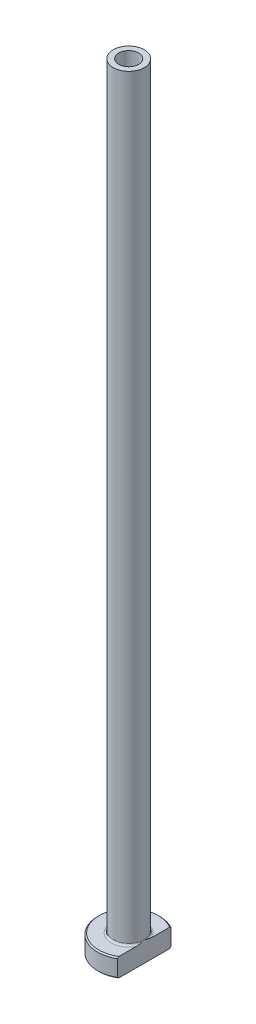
ISO-10303-21;
HEADER;
FILE_DESCRIPTION(('STEP AP214'),'2;1');
FILE_NAME('part.step','',(''),(''),'','','');
FILE_SCHEMA(('AUTOMOTIVE_DESIGN { 1 0 10303 214 1 1 1 1 }'));
ENDSEC;
DATA;
#1=APPLICATION_CONTEXT('core data for automotive mechanical design processes');
#2=APPLICATION_PROTOCOL_DEFINITION('international standard','automotive_design',2000,#1);
#3=PRODUCT_CONTEXT('',#1,'mechanical');
#4=PRODUCT('Part','Part','',(#3));
#5=PRODUCT_RELATED_PRODUCT_CATEGORY('part','',(#4));
#6=PRODUCT_DEFINITION_FORMATION('','',#4);
#7=PRODUCT_DEFINITION_CONTEXT('part definition',#1,'design');
#8=PRODUCT_DEFINITION('design','',#6,#7);
#9=PRODUCT_DEFINITION_SHAPE('','',#8);
#10=(LENGTH_UNIT() NAMED_UNIT(*) SI_UNIT(.MILLI.,.METRE.));
#11=(NAMED_UNIT(*) PLANE_ANGLE_UNIT() SI_UNIT($,.RADIAN.));
#12=(NAMED_UNIT(*) SI_UNIT($,.STERADIAN.) SOLID_ANGLE_UNIT());
#13=UNCERTAINTY_MEASURE_WITH_UNIT(LENGTH_MEASURE(1.E-05),#10,'distance_accuracy_value','');
#14=(GEOMETRIC_REPRESENTATION_CONTEXT(3) GLOBAL_UNCERTAINTY_ASSIGNED_CONTEXT((#13)) GLOBAL_UNIT_ASSIGNED_CONTEXT((#10,
#11,#12)) REPRESENTATION_CONTEXT('',''));
#15=CARTESIAN_POINT('',(0.,0.,0.));
#16=DIRECTION('',(0.,0.,1.));
#17=DIRECTION('',(1.,0.,0.));
#18=AXIS2_PLACEMENT_3D('',#15,#16,#17);
#19=CARTESIAN_POINT('',(0.,92.1876809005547,0.));
#20=DIRECTION('',(0.,1.,0.));
#21=DIRECTION('',(0.,0.,1.));
#22=AXIS2_PLACEMENT_3D('',#19,#20,#21);
#23=CYLINDRICAL_SURFACE('',#22,1.6);
#24=CARTESIAN_POINT('',(0.,125.,0.));
#25=DIRECTION('',(0.,1.,0.));
#26=DIRECTION('',(0.,0.,1.));
#27=AXIS2_PLACEMENT_3D('',#24,#25,#26);
#28=CIRCLE('',#27,1.6);
#29=CARTESIAN_POINT('',(0.,125.,1.6));
#30=VERTEX_POINT('',#29);
#31=EDGE_CURVE('E167',#30,#30,#28,.T.);
#32=ORIENTED_EDGE('',*,*,#31,.T.);
#33=EDGE_LOOP('',(#32));
#34=FACE_BOUND('',#33,.T.);
#35=CARTESIAN_POINT('',(0.,80.,0.));
#36=DIRECTION('',(0.,1.,0.));
#37=DIRECTION('',(0.,0.,1.));
#38=AXIS2_PLACEMENT_3D('',#35,#36,#37);
#39=CIRCLE('',#38,1.6);
#40=CARTESIAN_POINT('',(0.,80.,1.6));
#41=VERTEX_POINT('',#40);
#42=EDGE_CURVE('E170',#41,#41,#39,.T.);
#43=ORIENTED_EDGE('',*,*,#42,.F.);
#44=EDGE_LOOP('',(#43));
#45=FACE_BOUND('',#44,.T.);
#46=ADVANCED_FACE('F32',(#34,#45),#23,.F.);
#47=CARTESIAN_POINT('',(-1.6,125.,0.));
#48=DIRECTION('',(0.,1.,0.));
#49=DIRECTION('',(0.,0.,1.));
#50=AXIS2_PLACEMENT_3D('',#47,#48,#49);
#51=PLANE('',#50);
#52=CARTESIAN_POINT('',(0.,125.,0.));
#53=DIRECTION('',(0.,1.,0.));
#54=DIRECTION('',(0.,0.,1.));
#55=AXIS2_PLACEMENT_3D('',#52,#53,#54);
#56=CIRCLE('',#55,2.5);
#57=CARTESIAN_POINT('',(0.,125.,2.5));
#58=VERTEX_POINT('',#57);
#59=EDGE_CURVE('E174',#58,#58,#56,.T.);
#60=ORIENTED_EDGE('',*,*,#59,.T.);
#61=EDGE_LOOP('',(#60));
#62=FACE_BOUND('',#61,.T.);
#63=ORIENTED_EDGE('',*,*,#31,.F.);
#64=EDGE_LOOP('',(#63));
#65=FACE_BOUND('',#64,.T.);
#66=ADVANCED_FACE('F157',(#62,#65),#51,.T.);
#67=CARTESIAN_POINT('',(0.,92.1876809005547,0.));
#68=DIRECTION('',(0.,1.,0.));
#69=DIRECTION('',(0.,0.,1.));
#70=AXIS2_PLACEMENT_3D('',#67,#68,#69);
#71=CYLINDRICAL_SURFACE('',#70,2.5);
#72=CARTESIAN_POINT('',(0.,3.3,0.));
#73=DIRECTION('',(0.,1.,0.));
#74=DIRECTION('',(0.,0.,1.));
#75=AXIS2_PLACEMENT_3D('',#72,#73,#74);
#76=CIRCLE('',#75,2.5);
#77=CARTESIAN_POINT('',(2.5,3.3,0.));
#78=VERTEX_POINT('',#77);
#79=EDGE_CURVE('E180',#78,#78,#76,.T.);
#80=ORIENTED_EDGE('',*,*,#79,.T.);
#81=EDGE_LOOP('',(#80));
#82=FACE_BOUND('',#81,.T.);
#83=ORIENTED_EDGE('',*,*,#59,.F.);
#84=EDGE_LOOP('',(#83));
#85=FACE_BOUND('',#84,.T.);
#86=ADVANCED_FACE('F162',(#82,#85),#71,.T.);
#87=CARTESIAN_POINT('',(-2.49999999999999,3.,0.));
#88=DIRECTION('',(0.,1.,0.));
#89=DIRECTION('',(0.,0.,1.));
#90=AXIS2_PLACEMENT_3D('',#87,#88,#89);
#91=PLANE('',#90);
#92=DIRECTION('',(0.,0.,1.));
#93=VECTOR('',#92,1.);
#94=CARTESIAN_POINT('',(2.49999999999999,3.,0.));
#95=LINE('',#94,#93);
#96=CARTESIAN_POINT('',(2.49999999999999,3.,-4.0975602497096));
#97=VERTEX_POINT('',#96);
#98=CARTESIAN_POINT('',(2.49999999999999,3.,-1.26095202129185));
#99=VERTEX_POINT('',#98);
#100=EDGE_CURVE('E54',#97,#99,#95,.T.);
#101=ORIENTED_EDGE('',*,*,#100,.F.);
#102=CARTESIAN_POINT('',(0.,3.,0.));
#103=DIRECTION('',(0.,1.,0.));
#104=DIRECTION('',(0.,0.,1.));
#105=AXIS2_PLACEMENT_3D('',#102,#103,#104);
#106=CIRCLE('',#105,4.80000000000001);
#107=CARTESIAN_POINT('',(2.49999999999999,3.,4.0975602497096));
#108=VERTEX_POINT('',#107);
#109=EDGE_CURVE('E186',#97,#108,#106,.T.);
#110=ORIENTED_EDGE('',*,*,#109,.T.);
#111=CARTESIAN_POINT('',(2.49999999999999,3.,1.26095202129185));
#112=VERTEX_POINT('',#111);
#113=EDGE_CURVE('E134',#112,#108,#95,.T.);
#114=ORIENTED_EDGE('',*,*,#113,.F.);
#115=CARTESIAN_POINT('',(0.,3.,0.));
#116=DIRECTION('',(0.,1.,0.));
#117=DIRECTION('',(0.,0.,1.));
#118=AXIS2_PLACEMENT_3D('',#115,#116,#117);
#119=CIRCLE('',#118,2.8);
#120=EDGE_CURVE('E183',#112,#99,#119,.F.);
#121=ORIENTED_EDGE('',*,*,#120,.T.);
#122=EDGE_LOOP('',(#101,#110,#114,#121));
#123=FACE_BOUND('',#122,.T.);
#124=ADVANCED_FACE('F197',(#123),#91,.T.);
#125=CARTESIAN_POINT('',(0.,92.1876809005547,0.));
#126=DIRECTION('',(0.,1.,0.));
#127=DIRECTION('',(0.,0.,1.));
#128=AXIS2_PLACEMENT_3D('',#125,#126,#127);
#129=CYLINDRICAL_SURFACE('',#128,4.99999999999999);
#130=DIRECTION('',(0.,-1.,0.));
#131=VECTOR('',#130,1.);
#132=CARTESIAN_POINT('',(2.49999999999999,125.,4.33012701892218));
#133=LINE('',#132,#131);
#134=CARTESIAN_POINT('',(2.49999999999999,2.80000000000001,4.33012701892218));
#135=VERTEX_POINT('',#134);
#136=CARTESIAN_POINT('',(2.49999999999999,0.200000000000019,4.33012701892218));
#137=VERTEX_POINT('',#136);
#138=EDGE_CURVE('E82',#135,#137,#133,.T.);
#139=ORIENTED_EDGE('',*,*,#138,.F.);
#140=CARTESIAN_POINT('',(0.,2.80000000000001,0.));
#141=DIRECTION('',(0.,1.,0.));
#142=DIRECTION('',(0.,0.,1.));
#143=AXIS2_PLACEMENT_3D('',#140,#141,#142);
#144=CIRCLE('',#143,4.99999999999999);
#145=CARTESIAN_POINT('',(2.49999999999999,2.80000000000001,-4.33012701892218));
#146=VERTEX_POINT('',#145);
#147=EDGE_CURVE('E95',#135,#146,#144,.F.);
#148=ORIENTED_EDGE('',*,*,#147,.T.);
#149=DIRECTION('',(0.,-1.,0.));
#150=VECTOR('',#149,1.);
#151=CARTESIAN_POINT('',(2.49999999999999,125.,-4.33012701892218));
#152=LINE('',#151,#150);
#153=CARTESIAN_POINT('',(2.49999999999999,0.20000000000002,-4.33012701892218));
#154=VERTEX_POINT('',#153);
#155=EDGE_CURVE('E192',#146,#154,#152,.T.);
#156=ORIENTED_EDGE('',*,*,#155,.T.);
#157=CARTESIAN_POINT('',(0.,0.20000000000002,0.));
#158=DIRECTION('',(0.,-1.,0.));
#159=DIRECTION('',(0.,0.,-1.));
#160=AXIS2_PLACEMENT_3D('',#157,#158,#159);
#161=CIRCLE('',#160,4.99999999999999);
#162=EDGE_CURVE('E98',#154,#137,#161,.F.);
#163=ORIENTED_EDGE('',*,*,#162,.T.);
#164=EDGE_LOOP('',(#139,#148,#156,#163));
#165=FACE_BOUND('',#164,.T.);
#166=ADVANCED_FACE('F190',(#165),#129,.T.);
#167=CARTESIAN_POINT('',(-4.99999999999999,0.,0.));
#168=DIRECTION('',(0.,-1.,0.));
#169=DIRECTION('',(0.,0.,-1.));
#170=AXIS2_PLACEMENT_3D('',#167,#168,#169);
#171=PLANE('',#170);
#172=CARTESIAN_POINT('',(0.,0.,0.));
#173=DIRECTION('',(0.,-1.,0.));
#174=DIRECTION('',(0.,0.,-1.));
#175=AXIS2_PLACEMENT_3D('',#172,#173,#174);
#176=CIRCLE('',#175,2.34999999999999);
#177=CARTESIAN_POINT('',(0.,0.,-2.34999999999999));
#178=VERTEX_POINT('',#177);
#179=EDGE_CURVE('E40',#178,#178,#176,.F.);
#180=ORIENTED_EDGE('',*,*,#179,.T.);
#181=EDGE_LOOP('',(#180));
#182=FACE_BOUND('',#181,.T.);
#183=DIRECTION('',(0.,0.,-1.));
#184=VECTOR('',#183,1.);
#185=CARTESIAN_POINT('',(2.49999999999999,0.,4.33012701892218));
#186=LINE('',#185,#184);
#187=CARTESIAN_POINT('',(2.49999999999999,0.,4.09756024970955));
#188=VERTEX_POINT('',#187);
#189=CARTESIAN_POINT('',(2.49999999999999,0.,-4.09756024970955));
#190=VERTEX_POINT('',#189);
#191=EDGE_CURVE('E47',#188,#190,#186,.T.);
#192=ORIENTED_EDGE('',*,*,#191,.F.);
#193=CARTESIAN_POINT('',(0.,0.,0.));
#194=DIRECTION('',(0.,-1.,0.));
#195=DIRECTION('',(0.,0.,-1.));
#196=AXIS2_PLACEMENT_3D('',#193,#194,#195);
#197=CIRCLE('',#196,4.79999999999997);
#198=EDGE_CURVE('E92',#188,#190,#197,.T.);
#199=ORIENTED_EDGE('',*,*,#198,.T.);
#200=EDGE_LOOP('',(#192,#199));
#201=FACE_BOUND('',#200,.T.);
#202=ADVANCED_FACE('F91',(#182,#201),#171,.T.);
#203=CARTESIAN_POINT('',(0.,92.1876809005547,0.));
#204=DIRECTION('',(0.,1.,0.));
#205=DIRECTION('',(0.,0.,1.));
#206=AXIS2_PLACEMENT_3D('',#203,#204,#205);
#207=CYLINDRICAL_SURFACE('',#206,1.84999999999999);
#208=CARTESIAN_POINT('',(0.,0.499999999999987,0.));
#209=DIRECTION('',(0.,-1.,0.));
#210=DIRECTION('',(0.,0.,-1.));
#211=AXIS2_PLACEMENT_3D('',#208,#209,#210);
#212=CIRCLE('',#211,1.84999999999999);
#213=CARTESIAN_POINT('',(0.,0.499999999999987,-1.84999999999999));
#214=VERTEX_POINT('',#213);
#215=EDGE_CURVE('E11',#214,#214,#212,.T.);
#216=ORIENTED_EDGE('',*,*,#215,.T.);
#217=EDGE_LOOP('',(#216));
#218=FACE_BOUND('',#217,.T.);
#219=CARTESIAN_POINT('',(0.,68.,0.));
#220=DIRECTION('',(0.,1.,0.));
#221=DIRECTION('',(0.,0.,1.));
#222=AXIS2_PLACEMENT_3D('',#219,#220,#221);
#223=CIRCLE('',#222,1.85);
#224=CARTESIAN_POINT('',(0.,68.,1.85));
#225=VERTEX_POINT('',#224);
#226=EDGE_CURVE('E172',#225,#225,#223,.T.);
#227=ORIENTED_EDGE('',*,*,#226,.T.);
#228=EDGE_LOOP('',(#227));
#229=FACE_BOUND('',#228,.T.);
#230=ADVANCED_FACE('F215',(#218,#229),#207,.F.);
#231=CARTESIAN_POINT('',(0.,68.,0.));
#232=DIRECTION('',(0.,-1.,0.));
#233=DIRECTION('',(0.,0.,-1.));
#234=AXIS2_PLACEMENT_3D('',#231,#232,#233);
#235=CONICAL_SURFACE('',#234,1.85,0.0208303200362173);
#236=ORIENTED_EDGE('',*,*,#42,.T.);
#237=EDGE_LOOP('',(#236));
#238=FACE_BOUND('',#237,.T.);
#239=ORIENTED_EDGE('',*,*,#226,.F.);
#240=EDGE_LOOP('',(#239));
#241=FACE_BOUND('',#240,.T.);
#242=ADVANCED_FACE('F111',(#238,#241),#235,.F.);
#243=CARTESIAN_POINT('',(0.,3.3,0.));
#244=DIRECTION('',(0.,1.,0.));
#245=DIRECTION('',(0.,0.,1.));
#246=AXIS2_PLACEMENT_3D('',#243,#244,#245);
#247=TOROIDAL_SURFACE('',#246,2.8,0.3);
#248=ORIENTED_EDGE('',*,*,#120,.F.);
#249=CARTESIAN_POINT('',(2.5,3.3,0.));
#250=CARTESIAN_POINT('',(2.5,3.30000062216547,-4.84269671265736E-11));
#251=CARTESIAN_POINT('',(2.5,3.30000124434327,1.5962098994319E-07));
#252=CARTESIAN_POINT('',(2.5,3.30000243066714,6.45477810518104E-07));
#253=CARTESIAN_POINT('',(2.5,3.30000299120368,9.78480509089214E-07));
#254=CARTESIAN_POINT('',(2.5,3.30000411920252,1.77471953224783E-06));
#255=CARTESIAN_POINT('',(2.5,3.30000467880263,2.24902111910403E-06));
#256=CARTESIAN_POINT('',(2.5,3.30000572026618,3.25953643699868E-06));
#257=CARTESIAN_POINT('',(2.5,3.30000620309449,3.79480705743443E-06));
#258=CARTESIAN_POINT('',(2.5,3.30000787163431,5.75794580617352E-06));
#259=CARTESIAN_POINT('',(2.5,3.30000896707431,7.26424060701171E-06));
#260=CARTESIAN_POINT('',(2.5,3.3000108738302,1.0336112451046E-05));
#261=CARTESIAN_POINT('',(2.5,3.30001169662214,1.18949494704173E-05));
#262=CARTESIAN_POINT('',(2.5,3.30001489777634,1.81400845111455E-05));
#263=CARTESIAN_POINT('',(2.5,3.3000171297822,2.29062169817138E-05));
#264=CARTESIAN_POINT('',(2.5,3.3000206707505,3.21793857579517E-05));
#265=CARTESIAN_POINT('',(2.5,3.30002205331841,3.66588979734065E-05));
#266=CARTESIAN_POINT('',(2.5,3.30002810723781,5.61718390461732E-05));
#267=CARTESIAN_POINT('',(2.5,3.30003284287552,7.11735846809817E-05));
#268=CARTESIAN_POINT('',(2.5,3.30004025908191,9.89920305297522E-05));
#269=CARTESIAN_POINT('',(2.49999999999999,3.30004315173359,0.000111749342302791));
#270=CARTESIAN_POINT('',(2.49999999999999,3.30006652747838,0.000206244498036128));
#271=CARTESIAN_POINT('',(2.49999999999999,3.30009698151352,0.000285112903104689));
#272=CARTESIAN_POINT('',(2.5,3.30021213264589,0.000594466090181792));
#273=CARTESIAN_POINT('',(2.5,3.30028938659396,0.000826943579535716));
#274=CARTESIAN_POINT('',(2.49999999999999,3.3005968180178,0.00173885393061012));
#275=CARTESIAN_POINT('',(2.49999999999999,3.30083479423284,0.00241625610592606));
#276=CARTESIAN_POINT('',(2.5,3.30181198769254,0.00521069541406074));
#277=CARTESIAN_POINT('',(2.5,3.30254240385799,0.00732996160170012));
#278=CARTESIAN_POINT('',(2.49999999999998,3.31226043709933,0.0355096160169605));
#279=CARTESIAN_POINT('',(2.49999999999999,3.3213080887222,0.0615551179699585));
#280=CARTESIAN_POINT('',(2.5,3.33896212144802,0.11267798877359));
#281=CARTESIAN_POINT('',(2.5,3.34757212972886,0.137754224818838));
#282=CARTESIAN_POINT('',(2.49999999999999,3.36573068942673,0.19098188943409));
#283=CARTESIAN_POINT('',(2.49999999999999,3.3752665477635,0.219137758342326));
#284=CARTESIAN_POINT('',(2.49999999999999,3.39422867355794,0.275816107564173));
#285=CARTESIAN_POINT('',(2.49999999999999,3.40365272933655,0.304339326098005));
#286=CARTESIAN_POINT('',(2.49999999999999,3.42641697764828,0.374416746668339));
#287=CARTESIAN_POINT('',(2.49999999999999,3.43959811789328,0.41602308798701));
#288=CARTESIAN_POINT('',(2.49999999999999,3.4647915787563,0.498481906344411));
#289=CARTESIAN_POINT('',(2.49999999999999,3.47682455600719,0.539328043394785));
#290=CARTESIAN_POINT('',(2.49999999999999,3.50224427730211,0.629981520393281));
#291=CARTESIAN_POINT('',(2.49999999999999,3.51538048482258,0.679860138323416));
#292=CARTESIAN_POINT('',(2.49999999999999,3.53964074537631,0.780511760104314));
#293=CARTESIAN_POINT('',(2.49999999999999,3.55074877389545,0.831288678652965));
#294=CARTESIAN_POINT('',(2.49999999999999,3.57087054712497,0.937063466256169));
#295=CARTESIAN_POINT('',(2.49999999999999,3.57967623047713,0.992102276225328));
#296=CARTESIAN_POINT('',(2.49999999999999,3.59301148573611,1.10256024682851));
#297=CARTESIAN_POINT('',(2.49999999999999,3.59755297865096,1.15797790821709));
#298=CARTESIAN_POINT('',(2.49999999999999,3.60093314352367,1.2678670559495));
#299=CARTESIAN_POINT('',(2.49999999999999,3.5998936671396,1.32233291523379));
#300=CARTESIAN_POINT('',(2.49999999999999,3.59277279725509,1.4031006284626));
#301=CARTESIAN_POINT('',(2.49999999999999,3.58952137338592,1.42965222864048));
#302=CARTESIAN_POINT('',(2.49999999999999,3.58085857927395,1.48239078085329));
#303=CARTESIAN_POINT('',(2.49999999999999,3.57544928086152,1.50857805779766));
#304=CARTESIAN_POINT('',(2.49999999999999,3.56298810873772,1.55658799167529));
#305=CARTESIAN_POINT('',(2.49999999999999,3.55628200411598,1.57849902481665));
#306=CARTESIAN_POINT('',(2.49999999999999,3.54055393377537,1.62160292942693));
#307=CARTESIAN_POINT('',(2.49999999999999,3.53152220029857,1.64279233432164));
#308=CARTESIAN_POINT('',(2.49999999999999,3.51057199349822,1.6840446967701));
#309=CARTESIAN_POINT('',(2.49999999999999,3.49862012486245,1.70409105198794));
#310=CARTESIAN_POINT('',(2.49999999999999,3.47134074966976,1.74172093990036));
#311=CARTESIAN_POINT('',(2.49999999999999,3.45603127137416,1.75931683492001));
#312=CARTESIAN_POINT('',(2.49999999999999,3.42979930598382,1.78297070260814));
#313=CARTESIAN_POINT('',(2.49999999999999,3.4202426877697,1.79054141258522));
#314=CARTESIAN_POINT('',(2.49999999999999,3.40009035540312,1.80416997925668));
#315=CARTESIAN_POINT('',(2.49999999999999,3.38949499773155,1.81022835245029));
#316=CARTESIAN_POINT('',(2.49999999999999,3.3672774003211,1.82047087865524));
#317=CARTESIAN_POINT('',(2.49999999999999,3.35564531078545,1.8246340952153));
#318=CARTESIAN_POINT('',(2.49999999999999,3.33178837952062,1.83058442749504));
#319=CARTESIAN_POINT('',(2.49999999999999,3.31956435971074,1.83237474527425));
#320=CARTESIAN_POINT('',(2.49999999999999,3.2966573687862,1.83331852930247));
#321=CARTESIAN_POINT('',(2.49999999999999,3.28598670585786,1.8327923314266));
#322=CARTESIAN_POINT('',(2.49999999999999,3.26490749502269,1.82986307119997));
#323=CARTESIAN_POINT('',(2.49999999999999,3.25449899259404,1.82745968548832));
#324=CARTESIAN_POINT('',(2.49999999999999,3.23467098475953,1.82111257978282));
#325=CARTESIAN_POINT('',(2.49999999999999,3.22522816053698,1.81724026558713));
#326=CARTESIAN_POINT('',(2.49999999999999,3.2069953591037,1.80819497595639));
#327=CARTESIAN_POINT('',(2.49999999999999,3.19820556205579,1.80302164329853));
#328=CARTESIAN_POINT('',(2.49999999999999,3.17663162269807,1.78842115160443));
#329=CARTESIAN_POINT('',(2.49999999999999,3.16436228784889,1.77823293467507));
#330=CARTESIAN_POINT('',(2.49999999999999,3.14157828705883,1.75604629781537));
#331=CARTESIAN_POINT('',(2.49999999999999,3.1310690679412,1.74404246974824));
#332=CARTESIAN_POINT('',(2.49999999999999,3.10600520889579,1.71142114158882));
#333=CARTESIAN_POINT('',(2.49999999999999,3.0926747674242,1.68986887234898));
#334=CARTESIAN_POINT('',(2.49999999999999,3.06940323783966,1.64508572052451));
#335=CARTESIAN_POINT('',(2.49999999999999,3.05946314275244,1.62185434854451));
#336=CARTESIAN_POINT('',(2.49999999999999,3.03545750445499,1.55546754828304));
#337=CARTESIAN_POINT('',(2.49999999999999,3.02444022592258,1.51122187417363));
#338=CARTESIAN_POINT('',(2.49999999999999,3.00863926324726,1.42119777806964));
#339=CARTESIAN_POINT('',(2.49999999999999,3.00393876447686,1.37540689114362));
#340=CARTESIAN_POINT('',(2.49999999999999,2.99924212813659,1.28072198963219));
#341=CARTESIAN_POINT('',(2.49999999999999,2.99956098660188,1.23181420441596));
#342=CARTESIAN_POINT('',(2.49999999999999,3.00436098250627,1.13410944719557));
#343=CARTESIAN_POINT('',(2.49999999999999,3.00885327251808,1.08531312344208));
#344=CARTESIAN_POINT('',(2.49999999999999,3.0207419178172,0.990773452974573));
#345=CARTESIAN_POINT('',(2.49999999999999,3.02796792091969,0.945007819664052));
#346=CARTESIAN_POINT('',(2.49999999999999,3.04465555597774,0.854199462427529));
#347=CARTESIAN_POINT('',(2.49999999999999,3.05410250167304,0.809153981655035));
#348=CARTESIAN_POINT('',(2.49999999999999,3.07710029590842,0.709411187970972));
#349=CARTESIAN_POINT('',(2.49999999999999,3.09109633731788,0.654817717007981));
#350=CARTESIAN_POINT('',(2.49999999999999,3.12140740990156,0.544863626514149));
#351=CARTESIAN_POINT('',(2.49999999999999,3.1377704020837,0.489516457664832));
#352=CARTESIAN_POINT('',(2.49999999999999,3.16649540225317,0.396740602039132));
#353=CARTESIAN_POINT('',(2.49999999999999,3.17848130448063,0.359193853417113));
#354=CARTESIAN_POINT('',(2.49999999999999,3.20280507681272,0.284651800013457));
#355=CARTESIAN_POINT('',(2.49999999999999,3.2151379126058,0.24765485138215));
#356=CARTESIAN_POINT('',(2.5,3.23873713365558,0.177767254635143));
#357=CARTESIAN_POINT('',(2.5,3.24997409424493,0.144866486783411));
#358=CARTESIAN_POINT('',(2.49999999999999,3.27307149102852,0.0777985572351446));
#359=CARTESIAN_POINT('',(2.49999999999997,3.28493883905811,0.0436336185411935));
#360=CARTESIAN_POINT('',(2.5,3.2974579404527,0.00732879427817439));
#361=CARTESIAN_POINT('',(2.5,3.29818879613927,0.00520838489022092));
#362=CARTESIAN_POINT('',(2.49999999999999,3.299166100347,0.0024136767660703));
#363=CARTESIAN_POINT('',(2.49999999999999,3.29940376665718,0.00173715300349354));
#364=CARTESIAN_POINT('',(2.5,3.29971082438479,0.000826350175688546));
#365=CARTESIAN_POINT('',(2.5,3.29978800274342,0.000594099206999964));
#366=CARTESIAN_POINT('',(2.49999999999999,3.29990305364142,0.000285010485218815));
#367=CARTESIAN_POINT('',(2.49999999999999,3.29993349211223,0.000206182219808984));
#368=CARTESIAN_POINT('',(2.49999999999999,3.29995685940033,0.000111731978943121));
#369=CARTESIAN_POINT('',(2.5,3.29995975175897,9.89774294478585E-05));
#370=CARTESIAN_POINT('',(2.5,3.29996716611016,7.11651859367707E-05));
#371=CARTESIAN_POINT('',(2.5,3.29997189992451,5.61668076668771E-05));
#372=CARTESIAN_POINT('',(2.5,3.2999779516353,3.66576314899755E-05));
#373=CARTESIAN_POINT('',(2.5,3.29997933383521,3.21785231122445E-05));
#374=CARTESIAN_POINT('',(2.5,3.29998287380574,2.2906136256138E-05));
#375=CARTESIAN_POINT('',(2.5,3.29998510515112,1.81403651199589E-05));
#376=CARTESIAN_POINT('',(2.5,3.29998830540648,1.18955815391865E-05));
#377=CARTESIAN_POINT('',(2.5,3.29998912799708,1.03367754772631E-05));
#378=CARTESIAN_POINT('',(2.5,3.29999103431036,7.26492716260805E-06));
#379=CARTESIAN_POINT('',(2.5,3.29999212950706,5.75862221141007E-06));
#380=CARTESIAN_POINT('',(2.5,3.29999379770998,3.79542421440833E-06));
#381=CARTESIAN_POINT('',(2.5,3.29999428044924,3.26012715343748E-06));
#382=CARTESIAN_POINT('',(2.5,3.29999532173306,2.24954292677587E-06));
#383=CARTESIAN_POINT('',(2.5,3.29999588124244,1.7751985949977E-06));
#384=CARTESIAN_POINT('',(2.5,3.29999700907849,9.78856846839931E-07));
#385=CARTESIAN_POINT('',(2.5,3.29999756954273,6.45796860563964E-07));
#386=CARTESIAN_POINT('',(2.5,3.29999875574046,1.59799527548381E-07));
#387=CARTESIAN_POINT('',(2.5,3.29999937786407,4.84251685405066E-11));
#388=CARTESIAN_POINT('',(2.5,3.3,0.));
#389=B_SPLINE_CURVE_WITH_KNOTS('',3,(#249,#250,#251,#252,#253,#254,#255,#256,#257,#258,#259,
#260,#261,#262,#263,#264,#265,#266,#267,#268,#269,#270,#271,#272,#273,#274,#275,#276,#277,#278,
#279,#280,#281,#282,#283,#284,#285,#286,#287,#288,#289,#290,#291,#292,#293,#294,#295,#296,#297,
#298,#299,#300,#301,#302,#303,#304,#305,#306,#307,#308,#309,#310,#311,#312,#313,#314,#315,#316,
#317,#318,#319,#320,#321,#322,#323,#324,#325,#326,#327,#328,#329,#330,#331,#332,#333,#334,#335,
#336,#337,#338,#339,#340,#341,#342,#343,#344,#345,#346,#347,#348,#349,#350,#351,#352,#353,#354,
#355,#356,#357,#358,#359,#360,#361,#362,#363,#364,#365,#366,#367,#368,#369,#370,#371,#372,#373,
#374,#375,#376,#377,#378,#379,#380,#381,#382,#383,#384,#385,#386,#387,#388),.UNSPECIFIED.,.T.,
.F.,(4,2,2,2,2,2,2,2,2,2,2,2,2,2,2,2,2,2,2,2,2,2,2,2,2,2,2,2,2,2,2,2,2,2,2,2,2,2,2,2,2,2,2,2,2,
2,2,2,2,2,2,2,2,2,2,2,2,2,2,2,2,2,2,2,2,2,2,2,2,4),(0.,1.86789290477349E-06,
3.81549719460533E-06,6.00610613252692E-06,8.16653149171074E-06,1.37285611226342E-05,
1.90122197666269E-05,3.47597317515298E-05,4.8808265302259E-05,9.59978473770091E-05,
0.00013520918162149,0.000388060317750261,0.00112364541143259,0.00327678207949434,
0.0100024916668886,0.0927120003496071,0.172253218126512,0.261432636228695,0.351551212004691,
0.482477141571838,0.610212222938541,0.764915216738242,0.920792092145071,1.08787897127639,
1.25449733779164,1.41749285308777,1.49767530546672,1.57778095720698,1.64642481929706,
1.7153618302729,1.78512750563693,1.85452737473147,1.89099315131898,1.92744645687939,
1.96429324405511,2.00109025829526,2.03297105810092,2.06485735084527,2.09535926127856,
2.1258695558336,2.17344034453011,2.22115572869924,2.29675134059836,2.37236907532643,
2.50839721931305,2.6461997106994,2.79268284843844,2.93955855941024,3.07848421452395,
3.21651583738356,3.38554045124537,3.55865938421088,3.6768964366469,3.79388863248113,
3.89819085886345,4.00668323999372,4.01341261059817,4.01556295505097,4.01629782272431,
4.01655054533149,4.01658974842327,4.01663692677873,4.01665097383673,4.0166667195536,
4.01667200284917,4.01667756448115,4.01667972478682,4.01668191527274,4.01668386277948,
4.0166857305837),.UNSPECIFIED.);
#390=EDGE_CURVE('E126',#112,#78,#389,.T.);
#391=ORIENTED_EDGE('',*,*,#390,.T.);
#392=ORIENTED_EDGE('',*,*,#79,.F.);
#393=CARTESIAN_POINT('',(2.5,3.3,0.));
#394=CARTESIAN_POINT('',(2.5,3.29999937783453,4.84274525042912E-11));
#395=CARTESIAN_POINT('',(2.5,3.29999875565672,-1.59620989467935E-07));
#396=CARTESIAN_POINT('',(2.5,3.29999756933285,-6.45477810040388E-07));
#397=CARTESIAN_POINT('',(2.5,3.29999700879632,-9.78480508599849E-07));
#398=CARTESIAN_POINT('',(2.5,3.29999588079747,-1.77471953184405E-06));
#399=CARTESIAN_POINT('',(2.5,3.29999532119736,-2.2490211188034E-06));
#400=CARTESIAN_POINT('',(2.5,3.29999427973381,-3.25953643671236E-06));
#401=CARTESIAN_POINT('',(2.5,3.29999379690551,-3.79480705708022E-06));
#402=CARTESIAN_POINT('',(2.5,3.29999212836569,-5.75794580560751E-06));
#403=CARTESIAN_POINT('',(2.5,3.29999103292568,-7.26424060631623E-06));
#404=CARTESIAN_POINT('',(2.5,3.29998912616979,-1.03361124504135E-05));
#405=CARTESIAN_POINT('',(2.5,3.29998830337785,-1.18949494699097E-05));
#406=CARTESIAN_POINT('',(2.5,3.29998510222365,-1.81400845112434E-05));
#407=CARTESIAN_POINT('',(2.5,3.29998287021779,-2.29062169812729E-05));
#408=CARTESIAN_POINT('',(2.5,3.29997932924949,-3.21793857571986E-05));
#409=CARTESIAN_POINT('',(2.5,3.29997794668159,-3.66588979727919E-05));
#410=CARTESIAN_POINT('',(2.5,3.29997189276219,-5.61718390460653E-05));
#411=CARTESIAN_POINT('',(2.5,3.29996715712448,-7.1173584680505E-05));
#412=CARTESIAN_POINT('',(2.5,3.29995974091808,-9.89920305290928E-05));
#413=CARTESIAN_POINT('',(2.49999999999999,3.2999568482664,-0.000111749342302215));
#414=CARTESIAN_POINT('',(2.49999999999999,3.29993347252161,-0.000206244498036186));
#415=CARTESIAN_POINT('',(2.49999999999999,3.29990301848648,-0.000285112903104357));
#416=CARTESIAN_POINT('',(2.5,3.2997878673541,-0.000594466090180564));
#417=CARTESIAN_POINT('',(2.5,3.29971061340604,-0.000826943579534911));
#418=CARTESIAN_POINT('',(2.49999999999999,3.2994031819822,-0.00173885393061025));
#419=CARTESIAN_POINT('',(2.49999999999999,3.29916520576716,-0.00241625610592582));
#420=CARTESIAN_POINT('',(2.5,3.29818801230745,-0.00521069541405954));
#421=CARTESIAN_POINT('',(2.5,3.297457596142,-0.00732996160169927));
#422=CARTESIAN_POINT('',(2.49999999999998,3.28773956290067,-0.0355096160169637));
#423=CARTESIAN_POINT('',(2.49999999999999,3.2786919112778,-0.0615551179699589));
#424=CARTESIAN_POINT('',(2.5,3.26103787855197,-0.112677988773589));
#425=CARTESIAN_POINT('',(2.5,3.25242787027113,-0.137754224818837));
#426=CARTESIAN_POINT('',(2.49999999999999,3.23426931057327,-0.190981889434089));
#427=CARTESIAN_POINT('',(2.49999999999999,3.22473345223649,-0.219137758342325));
#428=CARTESIAN_POINT('',(2.49999999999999,3.20577132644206,-0.275816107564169));
#429=CARTESIAN_POINT('',(2.49999999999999,3.19634727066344,-0.304339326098));
#430=CARTESIAN_POINT('',(2.49999999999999,3.17358302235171,-0.374416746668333));
#431=CARTESIAN_POINT('',(2.49999999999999,3.16040188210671,-0.416023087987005));
#432=CARTESIAN_POINT('',(2.49999999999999,3.1352084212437,-0.498481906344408));
#433=CARTESIAN_POINT('',(2.49999999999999,3.12317544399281,-0.539328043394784));
#434=CARTESIAN_POINT('',(2.49999999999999,3.09775572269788,-0.629981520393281));
#435=CARTESIAN_POINT('',(2.49999999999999,3.08461951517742,-0.679860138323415));
#436=CARTESIAN_POINT('',(2.49999999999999,3.06035925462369,-0.780511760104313));
#437=CARTESIAN_POINT('',(2.49999999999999,3.04925122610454,-0.831288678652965));
#438=CARTESIAN_POINT('',(2.49999999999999,3.02912945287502,-0.937063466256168));
#439=CARTESIAN_POINT('',(2.49999999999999,3.02032376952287,-0.992102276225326));
#440=CARTESIAN_POINT('',(2.49999999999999,3.00698851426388,-1.10256024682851));
#441=CARTESIAN_POINT('',(2.49999999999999,3.00244702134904,-1.15797790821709));
#442=CARTESIAN_POINT('',(2.49999999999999,2.99906685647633,-1.2678670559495));
#443=CARTESIAN_POINT('',(2.49999999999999,3.00010633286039,-1.32233291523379));
#444=CARTESIAN_POINT('',(2.49999999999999,3.00722720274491,-1.4031006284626));
#445=CARTESIAN_POINT('',(2.49999999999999,3.01047862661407,-1.42965222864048));
#446=CARTESIAN_POINT('',(2.49999999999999,3.01914142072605,-1.48239078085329));
#447=CARTESIAN_POINT('',(2.49999999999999,3.02455071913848,-1.50857805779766));
#448=CARTESIAN_POINT('',(2.49999999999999,3.03701189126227,-1.55658799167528));
#449=CARTESIAN_POINT('',(2.49999999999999,3.04371799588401,-1.57849902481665));
#450=CARTESIAN_POINT('',(2.49999999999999,3.05944606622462,-1.62160292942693));
#451=CARTESIAN_POINT('',(2.49999999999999,3.06847779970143,-1.64279233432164));
#452=CARTESIAN_POINT('',(2.49999999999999,3.08942800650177,-1.6840446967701));
#453=CARTESIAN_POINT('',(2.49999999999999,3.10137987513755,-1.70409105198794));
#454=CARTESIAN_POINT('',(2.49999999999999,3.12865925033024,-1.74172093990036));
#455=CARTESIAN_POINT('',(2.49999999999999,3.14396872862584,-1.75931683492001));
#456=CARTESIAN_POINT('',(2.49999999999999,3.17020069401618,-1.78297070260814));
#457=CARTESIAN_POINT('',(2.49999999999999,3.1797573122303,-1.79054141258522));
#458=CARTESIAN_POINT('',(2.49999999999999,3.19990964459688,-1.80416997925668));
#459=CARTESIAN_POINT('',(2.49999999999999,3.21050500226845,-1.81022835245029));
#460=CARTESIAN_POINT('',(2.49999999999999,3.23272259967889,-1.82047087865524));
#461=CARTESIAN_POINT('',(2.49999999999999,3.24435468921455,-1.8246340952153));
#462=CARTESIAN_POINT('',(2.49999999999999,3.26821162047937,-1.83058442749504));
#463=CARTESIAN_POINT('',(2.49999999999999,3.28043564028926,-1.83237474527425));
#464=CARTESIAN_POINT('',(2.49999999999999,3.30334263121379,-1.83331852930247));
#465=CARTESIAN_POINT('',(2.49999999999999,3.31401329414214,-1.8327923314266));
#466=CARTESIAN_POINT('',(2.49999999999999,3.3350925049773,-1.82986307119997));
#467=CARTESIAN_POINT('',(2.49999999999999,3.34550100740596,-1.82745968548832));
#468=CARTESIAN_POINT('',(2.49999999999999,3.36532901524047,-1.82111257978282));
#469=CARTESIAN_POINT('',(2.49999999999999,3.37477183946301,-1.81724026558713));
#470=CARTESIAN_POINT('',(2.49999999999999,3.3930046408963,-1.80819497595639));
#471=CARTESIAN_POINT('',(2.49999999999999,3.40179443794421,-1.80302164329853));
#472=CARTESIAN_POINT('',(2.49999999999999,3.42336837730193,-1.78842115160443));
#473=CARTESIAN_POINT('',(2.49999999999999,3.4356377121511,-1.77823293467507));
#474=CARTESIAN_POINT('',(2.49999999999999,3.45842171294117,-1.75604629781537));
#475=CARTESIAN_POINT('',(2.49999999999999,3.46893093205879,-1.74404246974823));
#476=CARTESIAN_POINT('',(2.49999999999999,3.49399479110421,-1.71142114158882));
#477=CARTESIAN_POINT('',(2.49999999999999,3.50732523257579,-1.68986887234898));
#478=CARTESIAN_POINT('',(2.49999999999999,3.53059676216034,-1.64508572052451));
#479=CARTESIAN_POINT('',(2.49999999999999,3.54053685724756,-1.6218543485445));
#480=CARTESIAN_POINT('',(2.49999999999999,3.56454249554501,-1.55546754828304));
#481=CARTESIAN_POINT('',(2.49999999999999,3.57555977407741,-1.51122187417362));
#482=CARTESIAN_POINT('',(2.49999999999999,3.59136073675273,-1.42119777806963));
#483=CARTESIAN_POINT('',(2.49999999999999,3.59606123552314,-1.3754068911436));
#484=CARTESIAN_POINT('',(2.49999999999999,3.6007578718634,-1.28072198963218));
#485=CARTESIAN_POINT('',(2.49999999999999,3.60043901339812,-1.23181420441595));
#486=CARTESIAN_POINT('',(2.49999999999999,3.59563901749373,-1.13410944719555));
#487=CARTESIAN_POINT('',(2.49999999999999,3.59114672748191,-1.08531312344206));
#488=CARTESIAN_POINT('',(2.49999999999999,3.57925808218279,-0.990773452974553));
#489=CARTESIAN_POINT('',(2.49999999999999,3.5720320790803,-0.94500781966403));
#490=CARTESIAN_POINT('',(2.49999999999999,3.55534444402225,-0.854199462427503));
#491=CARTESIAN_POINT('',(2.49999999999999,3.54589749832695,-0.809153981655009));
#492=CARTESIAN_POINT('',(2.49999999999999,3.52289970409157,-0.709411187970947));
#493=CARTESIAN_POINT('',(2.49999999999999,3.50890366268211,-0.654817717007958));
#494=CARTESIAN_POINT('',(2.49999999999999,3.47859259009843,-0.544863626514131));
#495=CARTESIAN_POINT('',(2.49999999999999,3.46222959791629,-0.489516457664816));
#496=CARTESIAN_POINT('',(2.49999999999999,3.43350459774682,-0.39674060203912));
#497=CARTESIAN_POINT('',(2.49999999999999,3.42151869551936,-0.359193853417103));
#498=CARTESIAN_POINT('',(2.49999999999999,3.39719492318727,-0.28465180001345));
#499=CARTESIAN_POINT('',(2.49999999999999,3.38486208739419,-0.247654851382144));
#500=CARTESIAN_POINT('',(2.5,3.36126286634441,-0.177767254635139));
#501=CARTESIAN_POINT('',(2.5,3.35002590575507,-0.144866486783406));
#502=CARTESIAN_POINT('',(2.49999999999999,3.32692850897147,-0.0777985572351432));
#503=CARTESIAN_POINT('',(2.49999999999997,3.31506116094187,-0.0436336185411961));
#504=CARTESIAN_POINT('',(2.5,3.3025420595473,-0.00732879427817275));
#505=CARTESIAN_POINT('',(2.5,3.30181120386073,-0.00520838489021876));
#506=CARTESIAN_POINT('',(2.49999999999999,3.300833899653,-0.00241367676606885));
#507=CARTESIAN_POINT('',(2.49999999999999,3.30059623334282,-0.0017371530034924));
#508=CARTESIAN_POINT('',(2.5,3.30028917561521,-0.000826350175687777));
#509=CARTESIAN_POINT('',(2.5,3.30021199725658,-0.000594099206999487));
#510=CARTESIAN_POINT('',(2.49999999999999,3.30009694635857,-0.000285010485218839));
#511=CARTESIAN_POINT('',(2.49999999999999,3.30006650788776,-0.000206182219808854));
#512=CARTESIAN_POINT('',(2.49999999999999,3.30004314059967,-0.000111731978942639));
#513=CARTESIAN_POINT('',(2.5,3.30004024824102,-9.89774294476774E-05));
#514=CARTESIAN_POINT('',(2.5,3.30003283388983,-7.11651859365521E-05));
#515=CARTESIAN_POINT('',(2.5,3.30002810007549,-5.61668076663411E-05));
#516=CARTESIAN_POINT('',(2.5,3.30002204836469,-3.66576314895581E-05));
#517=CARTESIAN_POINT('',(2.5,3.30002066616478,-3.21785231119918E-05));
#518=CARTESIAN_POINT('',(2.5,3.30001712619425,-2.29061362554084E-05));
#519=CARTESIAN_POINT('',(2.5,3.30001489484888,-1.81403651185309E-05));
#520=CARTESIAN_POINT('',(2.5,3.30001169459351,-1.18955815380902E-05));
#521=CARTESIAN_POINT('',(2.5,3.30001087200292,-1.03367754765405E-05));
#522=CARTESIAN_POINT('',(2.5,3.30000896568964,-7.26492716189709E-06));
#523=CARTESIAN_POINT('',(2.5,3.30000787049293,-5.75862221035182E-06));
#524=CARTESIAN_POINT('',(2.5,3.30000620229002,-3.79542421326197E-06));
#525=CARTESIAN_POINT('',(2.5,3.30000571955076,-3.26012715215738E-06));
#526=CARTESIAN_POINT('',(2.5,3.30000467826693,-2.24954292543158E-06));
#527=CARTESIAN_POINT('',(2.5,3.30000411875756,-1.77519859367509E-06));
#528=CARTESIAN_POINT('',(2.5,3.30000299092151,-9.78856845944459E-07));
#529=CARTESIAN_POINT('',(2.5,3.30000243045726,-6.45796860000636E-07));
#530=CARTESIAN_POINT('',(2.5,3.30000124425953,-1.59799527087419E-07));
#531=CARTESIAN_POINT('',(2.5,3.30000062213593,-4.84246523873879E-11));
#532=CARTESIAN_POINT('',(2.5,3.3,0.));
#533=B_SPLINE_CURVE_WITH_KNOTS('',3,(#393,#394,#395,#396,#397,#398,#399,#400,#401,#402,#403,
#404,#405,#406,#407,#408,#409,#410,#411,#412,#413,#414,#415,#416,#417,#418,#419,#420,#421,#422,
#423,#424,#425,#426,#427,#428,#429,#430,#431,#432,#433,#434,#435,#436,#437,#438,#439,#440,#441,
#442,#443,#444,#445,#446,#447,#448,#449,#450,#451,#452,#453,#454,#455,#456,#457,#458,#459,#460,
#461,#462,#463,#464,#465,#466,#467,#468,#469,#470,#471,#472,#473,#474,#475,#476,#477,#478,#479,
#480,#481,#482,#483,#484,#485,#486,#487,#488,#489,#490,#491,#492,#493,#494,#495,#496,#497,#498,
#499,#500,#501,#502,#503,#504,#505,#506,#507,#508,#509,#510,#511,#512,#513,#514,#515,#516,#517,
#518,#519,#520,#521,#522,#523,#524,#525,#526,#527,#528,#529,#530,#531,#532),.UNSPECIFIED.,.T.,
.F.,(4,2,2,2,2,2,2,2,2,2,2,2,2,2,2,2,2,2,2,2,2,2,2,2,2,2,2,2,2,2,2,2,2,2,2,2,2,2,2,2,2,2,2,2,2,
2,2,2,2,2,2,2,2,2,2,2,2,2,2,2,2,2,2,2,2,2,2,2,2,4),(0.,1.86789290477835E-06,
3.81549719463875E-06,6.00610613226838E-06,8.16653149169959E-06,1.37285611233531E-05,
1.90122197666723E-05,3.47597317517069E-05,4.88082653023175E-05,9.59978473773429E-05,
0.000135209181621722,0.000388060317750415,0.00112364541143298,0.00327678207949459,
0.0100024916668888,0.092712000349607,0.172253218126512,0.261432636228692,0.351551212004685,
0.482477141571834,0.610212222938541,0.764915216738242,0.920792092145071,1.08787897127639,
1.25449733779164,1.41749285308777,1.49767530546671,1.57778095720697,1.64642481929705,
1.7153618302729,1.78512750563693,1.85452737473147,1.89099315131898,1.92744645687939,
1.96429324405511,2.00109025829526,2.03297105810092,2.06485735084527,2.09535926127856,
2.1258695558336,2.17344034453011,2.22115572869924,2.29675134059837,2.37236907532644,
2.50839721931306,2.64619971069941,2.79268284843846,2.93955855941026,3.07848421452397,
3.21651583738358,3.38554045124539,3.55865938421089,3.6768964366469,3.79388863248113,
3.89819085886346,4.00668323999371,4.01341261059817,4.01556295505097,4.0162978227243,
4.01655054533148,4.01658974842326,4.01663692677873,4.01665097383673,4.0166667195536,
4.01667200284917,4.01667756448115,4.01667972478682,4.01668191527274,4.01668386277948,
4.0166857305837),.UNSPECIFIED.);
#534=EDGE_CURVE('E135',#78,#99,#533,.T.);
#535=ORIENTED_EDGE('',*,*,#534,.T.);
#536=EDGE_LOOP('',(#248,#391,#392,#535));
#537=FACE_BOUND('',#536,.T.);
#538=ADVANCED_FACE('F141',(#537),#247,.F.);
#539=CARTESIAN_POINT('',(0.,3.,0.));
#540=DIRECTION('',(0.,-1.,0.));
#541=DIRECTION('',(0.,0.,-1.));
#542=AXIS2_PLACEMENT_3D('',#539,#540,#541);
#543=CONICAL_SURFACE('',#542,4.80000000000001,0.785398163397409);
#544=CARTESIAN_POINT('',(2.5,-2.05039133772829,-9.52786489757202));
#545=CARTESIAN_POINT('',(2.5,-1.84160367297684,-9.31199733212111));
#546=CARTESIAN_POINT('',(2.5,-1.63304008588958,-9.09591231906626));
#547=CARTESIAN_POINT('',(2.5,-1.21649358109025,-8.66317810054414));
#548=CARTESIAN_POINT('',(2.5,-1.00851067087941,-8.44652888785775));
#549=CARTESIAN_POINT('',(2.5,-0.593157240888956,-8.01243155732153));
#550=CARTESIAN_POINT('',(2.5,-0.385787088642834,-7.79498308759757));
#551=CARTESIAN_POINT('',(2.5,0.0280365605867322,-7.35921771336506));
#552=CARTESIAN_POINT('',(2.5,0.23449006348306,-7.14090081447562));
#553=CARTESIAN_POINT('',(2.5,0.642130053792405,-6.70748960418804));
#554=CARTESIAN_POINT('',(2.49999999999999,0.843339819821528,-6.49241720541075));
#555=CARTESIAN_POINT('',(2.49999999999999,1.24425381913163,-6.06087422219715));
#556=CARTESIAN_POINT('',(2.49999999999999,1.44395806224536,-5.84440364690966));
#557=CARTESIAN_POINT('',(2.49999999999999,1.84127751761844,-5.40963663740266));
#558=CARTESIAN_POINT('',(2.49999999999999,2.03889317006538,-5.19134060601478));
#559=CARTESIAN_POINT('',(2.49999999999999,2.4312504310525,-4.75218509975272));
#560=CARTESIAN_POINT('',(2.49999999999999,2.62599215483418,-4.53132572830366));
#561=CARTESIAN_POINT('',(2.49999999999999,2.93693788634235,-4.17181619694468));
#562=CARTESIAN_POINT('',(2.49999999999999,3.05446493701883,-4.03431188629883));
#563=CARTESIAN_POINT('',(2.49999999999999,3.28742704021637,-3.75751486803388));
#564=CARTESIAN_POINT('',(2.49999999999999,3.40286188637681,-3.6182219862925));
#565=CARTESIAN_POINT('',(2.49999999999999,3.63213234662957,-3.33586492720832));
#566=CARTESIAN_POINT('',(2.49999999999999,3.74593818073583,-3.19277645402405));
#567=CARTESIAN_POINT('',(2.49999999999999,3.96956266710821,-2.90356071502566));
#568=CARTESIAN_POINT('',(2.49999999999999,4.07938227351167,-2.75743418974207));
#569=CARTESIAN_POINT('',(2.49999999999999,4.29502410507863,-2.45881038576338));
#570=CARTESIAN_POINT('',(2.49999999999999,4.40076032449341,-2.30625006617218));
#571=CARTESIAN_POINT('',(2.49999999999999,4.55286945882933,-2.07299325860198));
#572=CARTESIAN_POINT('',(2.49999999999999,4.60252613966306,-1.99444197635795));
#573=CARTESIAN_POINT('',(2.49999999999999,4.69908164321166,-1.83566827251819));
#574=CARTESIAN_POINT('',(2.49999999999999,4.74598077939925,-1.75544604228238));
#575=CARTESIAN_POINT('',(2.49999999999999,4.83578466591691,-1.59405362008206));
#576=CARTESIAN_POINT('',(2.49999999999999,4.87873126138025,-1.51290702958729));
#577=CARTESIAN_POINT('',(2.49999999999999,4.96038600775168,-1.34852090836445));
#578=CARTESIAN_POINT('',(2.49999999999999,4.99909338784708,-1.26528100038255));
#579=CARTESIAN_POINT('',(2.49999999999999,5.10703093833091,-1.01251774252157));
#580=CARTESIAN_POINT('',(2.49999999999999,5.16843307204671,-0.839342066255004));
#581=CARTESIAN_POINT('',(2.49999999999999,5.23490554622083,-0.579703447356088));
#582=CARTESIAN_POINT('',(2.49999999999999,5.2525380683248,-0.49642168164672));
#583=CARTESIAN_POINT('',(2.49999999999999,5.27986337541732,-0.328535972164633));
#584=CARTESIAN_POINT('',(2.49999999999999,5.28955686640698,-0.243932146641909));
#585=CARTESIAN_POINT('',(2.49999999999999,5.30031768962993,-0.0744340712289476));
#586=CARTESIAN_POINT('',(2.49999999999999,5.30141176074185,0.0104584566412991));
#587=CARTESIAN_POINT('',(2.49999999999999,5.2949653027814,0.179916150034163));
#588=CARTESIAN_POINT('',(2.49999999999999,5.28742406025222,0.264481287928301));
#589=CARTESIAN_POINT('',(2.49999999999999,5.26433424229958,0.431754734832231));
#590=CARTESIAN_POINT('',(2.49999999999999,5.24885436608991,0.514472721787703));
#591=CARTESIAN_POINT('',(2.49999999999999,5.21085318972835,0.678257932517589));
#592=CARTESIAN_POINT('',(2.49999999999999,5.18833104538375,0.759324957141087));
#593=CARTESIAN_POINT('',(2.49999999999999,5.13718929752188,0.920001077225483));
#594=CARTESIAN_POINT('',(2.49999999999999,5.10853534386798,0.999599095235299));
#595=CARTESIAN_POINT('',(2.49999999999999,5.04628092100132,1.15679278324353));
#596=CARTESIAN_POINT('',(2.49999999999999,5.01268146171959,1.23438885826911));
#597=CARTESIAN_POINT('',(2.49999999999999,4.90558195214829,1.46503672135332));
#598=CARTESIAN_POINT('',(2.49999999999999,4.82601567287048,1.61526350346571));
#599=CARTESIAN_POINT('',(2.49999999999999,4.65635232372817,1.90970759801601));
#600=CARTESIAN_POINT('',(2.49999999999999,4.56624199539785,2.05391702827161));
#601=CARTESIAN_POINT('',(2.49999999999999,4.37862201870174,2.33821627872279));
#602=CARTESIAN_POINT('',(2.49999999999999,4.28108460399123,2.47828761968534));
#603=CARTESIAN_POINT('',(2.49999999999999,4.08116271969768,2.75478641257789));
#604=CARTESIAN_POINT('',(2.49999999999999,3.97878070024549,2.89121565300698));
#605=CARTESIAN_POINT('',(2.49999999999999,3.7691391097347,3.16313520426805));
#606=CARTESIAN_POINT('',(2.49999999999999,3.6618330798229,3.29858952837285));
#607=CARTESIAN_POINT('',(2.49999999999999,3.44456217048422,3.56736427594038));
#608=CARTESIAN_POINT('',(2.49999999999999,3.33459700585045,3.70068446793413));
#609=CARTESIAN_POINT('',(2.49999999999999,3.11293465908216,3.96532340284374));
#610=CARTESIAN_POINT('',(2.49999999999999,3.00124232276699,4.09664621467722));
#611=CARTESIAN_POINT('',(2.49999999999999,2.77631276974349,4.35796341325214));
#612=CARTESIAN_POINT('',(2.49999999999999,2.66307552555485,4.48795777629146));
#613=CARTESIAN_POINT('',(2.49999999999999,2.36028773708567,4.83228553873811));
#614=CARTESIAN_POINT('',(2.49999999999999,2.16967435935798,5.04568363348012));
#615=CARTESIAN_POINT('',(2.49999999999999,1.78611780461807,5.47037913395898));
#616=CARTESIAN_POINT('',(2.49999999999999,1.59317456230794,5.6816764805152));
#617=CARTESIAN_POINT('',(2.49999999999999,1.20540648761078,6.10290357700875));
#618=CARTESIAN_POINT('',(2.49999999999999,1.01058005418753,6.31283185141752));
#619=CARTESIAN_POINT('',(2.49999999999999,0.619649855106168,6.73149551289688));
#620=CARTESIAN_POINT('',(2.49999999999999,0.423546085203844,6.94023089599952));
#621=CARTESIAN_POINT('',(2.49999999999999,0.0384434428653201,7.34820392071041));
#622=CARTESIAN_POINT('',(2.49999999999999,-0.150515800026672,7.54747899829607));
#623=CARTESIAN_POINT('',(2.49999999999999,-0.52915332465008,7.94534601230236));
#624=CARTESIAN_POINT('',(2.49999999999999,-0.718831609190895,8.14393794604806));
#625=CARTESIAN_POINT('',(2.49999999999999,-1.09855461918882,8.54034636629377));
#626=CARTESIAN_POINT('',(2.49999999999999,-1.28859869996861,8.73816347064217));
#627=CARTESIAN_POINT('',(2.49999999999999,-1.66916268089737,9.13333639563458));
#628=CARTESIAN_POINT('',(2.49999999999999,-1.85968257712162,9.33069222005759));
#629=CARTESIAN_POINT('',(2.49999999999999,-2.05039133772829,9.52786489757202));
#630=B_SPLINE_CURVE_WITH_KNOTS('',3,(#544,#545,#546,#547,#548,#549,#550,#551,#552,#553,#554,
#555,#556,#557,#558,#559,#560,#561,#562,#563,#564,#565,#566,#567,#568,#569,#570,#571,#572,#573,
#574,#575,#576,#577,#578,#579,#580,#581,#582,#583,#584,#585,#586,#587,#588,#589,#590,#591,#592,
#593,#594,#595,#596,#597,#598,#599,#600,#601,#602,#603,#604,#605,#606,#607,#608,#609,#610,#611,
#612,#613,#614,#615,#616,#617,#618,#619,#620,#621,#622,#623,#624,#625,#626,#627,#628,#629),
.UNSPECIFIED.,.F.,.F.,(4,2,2,2,2,2,2,2,2,2,2,2,2,2,2,2,2,2,2,2,2,2,2,2,2,2,2,2,2,2,2,2,2,2,2,2,
2,2,2,2,2,2,4),(0.,0.900955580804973,1.80192274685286,2.70335062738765,3.60477268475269,
4.48832484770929,5.37187123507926,6.25522753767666,7.13854832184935,7.68119321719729,
8.22389134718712,8.77232299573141,9.32062249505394,9.87724663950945,10.155993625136,
10.4347088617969,10.7100145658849,10.98537024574,11.5339745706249,11.7890461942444,
12.0440951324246,12.2983507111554,12.5526272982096,12.8047396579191,13.0568822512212,
13.3104761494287,13.5640183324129,14.0732618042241,14.5831526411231,15.0950533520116,
15.6066978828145,16.1250759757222,16.6435099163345,17.1606868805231,17.6778730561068,
18.5362451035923,19.3946412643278,20.2538459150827,21.1130534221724,21.9369112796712,
22.7607723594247,23.5837145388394,24.4066499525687),.UNSPECIFIED.);
#631=EDGE_CURVE('E133',#146,#97,#630,.T.);
#632=ORIENTED_EDGE('',*,*,#631,.F.);
#633=ORIENTED_EDGE('',*,*,#147,.F.);
#634=EDGE_CURVE('E118',#108,#135,#630,.T.);
#635=ORIENTED_EDGE('',*,*,#634,.F.);
#636=ORIENTED_EDGE('',*,*,#109,.F.);
#637=EDGE_LOOP('',(#632,#633,#635,#636));
#638=FACE_BOUND('',#637,.T.);
#639=ADVANCED_FACE('F145',(#638),#543,.T.);
#640=CARTESIAN_POINT('',(0.,0.20000000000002,0.));
#641=DIRECTION('',(0.,1.,0.));
#642=DIRECTION('',(0.,0.,1.));
#643=AXIS2_PLACEMENT_3D('',#640,#641,#642);
#644=CONICAL_SURFACE('',#643,4.99999999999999,0.785398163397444);
#645=CARTESIAN_POINT('',(2.49999999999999,5.05039133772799,9.52786489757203));
#646=CARTESIAN_POINT('',(2.49999999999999,4.84160367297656,9.31199733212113));
#647=CARTESIAN_POINT('',(2.49999999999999,4.63304008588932,9.09591231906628));
#648=CARTESIAN_POINT('',(2.49999999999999,4.21649358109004,8.66317810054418));
#649=CARTESIAN_POINT('',(2.49999999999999,4.00851067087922,8.4465288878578));
#650=CARTESIAN_POINT('',(2.49999999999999,3.59315724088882,8.01243155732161));
#651=CARTESIAN_POINT('',(2.49999999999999,3.38578708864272,7.79498308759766));
#652=CARTESIAN_POINT('',(2.49999999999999,2.97196343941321,7.35921771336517));
#653=CARTESIAN_POINT('',(2.49999999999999,2.7655099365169,7.14090081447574));
#654=CARTESIAN_POINT('',(2.49999999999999,2.3578699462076,6.70748960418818));
#655=CARTESIAN_POINT('',(2.49999999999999,2.1566601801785,6.49241720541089));
#656=CARTESIAN_POINT('',(2.49999999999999,1.75574618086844,6.06087422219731));
#657=CARTESIAN_POINT('',(2.49999999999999,1.55604193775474,5.84440364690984));
#658=CARTESIAN_POINT('',(2.49999999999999,1.1587224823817,5.40963663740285));
#659=CARTESIAN_POINT('',(2.49999999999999,0.961106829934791,5.19134060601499));
#660=CARTESIAN_POINT('',(2.49999999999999,0.568749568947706,4.75218509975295));
#661=CARTESIAN_POINT('',(2.49999999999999,0.374007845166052,4.5313257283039));
#662=CARTESIAN_POINT('',(2.49999999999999,0.0630621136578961,4.17181619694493));
#663=CARTESIAN_POINT('',(2.49999999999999,-0.0544649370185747,4.03431188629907));
#664=CARTESIAN_POINT('',(2.49999999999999,-0.287427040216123,3.7575148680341));
#665=CARTESIAN_POINT('',(2.49999999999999,-0.402861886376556,3.61822198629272));
#666=CARTESIAN_POINT('',(2.49999999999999,-0.632132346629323,3.33586492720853));
#667=CARTESIAN_POINT('',(2.49999999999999,-0.745938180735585,3.19277645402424));
#668=CARTESIAN_POINT('',(2.49999999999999,-0.969562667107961,2.90356071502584));
#669=CARTESIAN_POINT('',(2.49999999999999,-1.07938227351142,2.75743418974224));
#670=CARTESIAN_POINT('',(2.49999999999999,-1.29502410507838,2.45881038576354));
#671=CARTESIAN_POINT('',(2.49999999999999,-1.40076032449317,2.30625006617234));
#672=CARTESIAN_POINT('',(2.49999999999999,-1.55286945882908,2.07299325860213));
#673=CARTESIAN_POINT('',(2.49999999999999,-1.60252613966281,1.9944419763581));
#674=CARTESIAN_POINT('',(2.49999999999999,-1.69908164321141,1.83566827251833));
#675=CARTESIAN_POINT('',(2.49999999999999,-1.74598077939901,1.75544604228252));
#676=CARTESIAN_POINT('',(2.49999999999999,-1.83578466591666,1.5940536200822));
#677=CARTESIAN_POINT('',(2.49999999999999,-1.87873126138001,1.51290702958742));
#678=CARTESIAN_POINT('',(2.49999999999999,-1.96038600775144,1.34852090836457));
#679=CARTESIAN_POINT('',(2.49999999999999,-1.99909338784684,1.26528100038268));
#680=CARTESIAN_POINT('',(2.49999999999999,-2.10703093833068,1.01251774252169));
#681=CARTESIAN_POINT('',(2.49999999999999,-2.16843307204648,0.839342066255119));
#682=CARTESIAN_POINT('',(2.49999999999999,-2.23490554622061,0.579703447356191));
#683=CARTESIAN_POINT('',(2.49999999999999,-2.25253806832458,0.496421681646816));
#684=CARTESIAN_POINT('',(2.49999999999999,-2.2798633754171,0.328535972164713));
#685=CARTESIAN_POINT('',(2.49999999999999,-2.28955686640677,0.243932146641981));
#686=CARTESIAN_POINT('',(2.49999999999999,-2.30031768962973,0.0744340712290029));
#687=CARTESIAN_POINT('',(2.49999999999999,-2.30141176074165,-0.0104584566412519));
#688=CARTESIAN_POINT('',(2.49999999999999,-2.2949653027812,-0.179916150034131));
#689=CARTESIAN_POINT('',(2.49999999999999,-2.28742406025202,-0.264481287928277));
#690=CARTESIAN_POINT('',(2.49999999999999,-2.26433424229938,-0.431754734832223));
#691=CARTESIAN_POINT('',(2.49999999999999,-2.24885436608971,-0.514472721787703));
#692=CARTESIAN_POINT('',(2.49999999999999,-2.21085318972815,-0.678257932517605));
#693=CARTESIAN_POINT('',(2.49999999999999,-2.18833104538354,-0.75932495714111));
#694=CARTESIAN_POINT('',(2.49999999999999,-2.13718929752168,-0.920001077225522));
#695=CARTESIAN_POINT('',(2.49999999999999,-2.10853534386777,-0.999599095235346));
#696=CARTESIAN_POINT('',(2.49999999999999,-2.0462809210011,-1.1567927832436));
#697=CARTESIAN_POINT('',(2.49999999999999,-2.01268146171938,-1.23438885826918));
#698=CARTESIAN_POINT('',(2.49999999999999,-1.90558195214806,-1.46503672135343));
#699=CARTESIAN_POINT('',(2.49999999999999,-1.82601567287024,-1.61526350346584));
#700=CARTESIAN_POINT('',(2.49999999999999,-1.6563523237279,-1.90970759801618));
#701=CARTESIAN_POINT('',(2.49999999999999,-1.56624199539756,-2.05391702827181));
#702=CARTESIAN_POINT('',(2.49999999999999,-1.37862201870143,-2.33821627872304));
#703=CARTESIAN_POINT('',(2.49999999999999,-1.2810846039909,-2.47828761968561));
#704=CARTESIAN_POINT('',(2.49999999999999,-1.08116271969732,-2.75478641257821));
#705=CARTESIAN_POINT('',(2.49999999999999,-0.978780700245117,-2.89121565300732));
#706=CARTESIAN_POINT('',(2.49999999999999,-0.769139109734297,-3.16313520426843));
#707=CARTESIAN_POINT('',(2.49999999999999,-0.66183307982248,-3.29858952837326));
#708=CARTESIAN_POINT('',(2.49999999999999,-0.444562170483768,-3.56736427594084));
#709=CARTESIAN_POINT('',(2.49999999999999,-0.334597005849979,-3.70068446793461));
#710=CARTESIAN_POINT('',(2.49999999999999,-0.112934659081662,-3.96532340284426));
#711=CARTESIAN_POINT('',(2.49999999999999,-0.00124232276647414,-4.09664621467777));
#712=CARTESIAN_POINT('',(2.49999999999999,0.223687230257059,-4.35796341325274));
#713=CARTESIAN_POINT('',(2.49999999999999,0.336924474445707,-4.48795777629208));
#714=CARTESIAN_POINT('',(2.49999999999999,0.639712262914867,-4.83228553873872));
#715=CARTESIAN_POINT('',(2.49999999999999,0.830325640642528,-5.0456836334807));
#716=CARTESIAN_POINT('',(2.49999999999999,1.21388219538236,-5.47037913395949));
#717=CARTESIAN_POINT('',(2.49999999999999,1.40682543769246,-5.68167648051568));
#718=CARTESIAN_POINT('',(2.49999999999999,1.79459351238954,-6.10290357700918));
#719=CARTESIAN_POINT('',(2.5,1.98941994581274,-6.31283185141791));
#720=CARTESIAN_POINT('',(2.5,2.38035014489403,-6.73149551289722));
#721=CARTESIAN_POINT('',(2.5,2.57645391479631,-6.94023089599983));
#722=CARTESIAN_POINT('',(2.5,2.96155655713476,-7.34820392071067));
#723=CARTESIAN_POINT('',(2.5,3.15051580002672,-7.5474789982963));
#724=CARTESIAN_POINT('',(2.5,3.52915332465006,-7.94534601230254));
#725=CARTESIAN_POINT('',(2.5,3.71883160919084,-8.14393794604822));
#726=CARTESIAN_POINT('',(2.5,4.09855461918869,-8.54034636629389));
#727=CARTESIAN_POINT('',(2.5,4.28859869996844,-8.73816347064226));
#728=CARTESIAN_POINT('',(2.5,4.66916268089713,-9.13333639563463));
#729=CARTESIAN_POINT('',(2.5,4.85968257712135,-9.33069222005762));
#730=CARTESIAN_POINT('',(2.5,5.05039133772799,-9.52786489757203));
#731=B_SPLINE_CURVE_WITH_KNOTS('',3,(#645,#646,#647,#648,#649,#650,#651,#652,#653,#654,#655,
#656,#657,#658,#659,#660,#661,#662,#663,#664,#665,#666,#667,#668,#669,#670,#671,#672,#673,#674,
#675,#676,#677,#678,#679,#680,#681,#682,#683,#684,#685,#686,#687,#688,#689,#690,#691,#692,#693,
#694,#695,#696,#697,#698,#699,#700,#701,#702,#703,#704,#705,#706,#707,#708,#709,#710,#711,#712,
#713,#714,#715,#716,#717,#718,#719,#720,#721,#722,#723,#724,#725,#726,#727,#728,#729,#730),
.UNSPECIFIED.,.F.,.F.,(4,2,2,2,2,2,2,2,2,2,2,2,2,2,2,2,2,2,2,2,2,2,2,2,2,2,2,2,2,2,2,2,2,2,2,2,
2,2,2,2,2,2,4),(0.,0.9009555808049,1.80192274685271,2.70335062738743,3.6047726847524,
4.48832484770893,5.37187123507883,6.25522753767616,7.13854832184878,7.68119321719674,
8.22389134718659,8.77232299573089,9.32062249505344,9.87724663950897,10.1559936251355,
10.4347088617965,10.7100145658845,10.9853702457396,11.5339745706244,11.789046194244,
12.0440951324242,12.2983507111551,12.5526272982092,12.8047396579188,13.0568822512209,
13.3104761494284,13.5640183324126,14.073261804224,14.5831526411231,15.0950533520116,
15.6066978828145,16.1250759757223,16.6435099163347,17.1606868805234,17.6778730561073,
18.5362451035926,19.394641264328,20.2538459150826,21.1130534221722,21.9369112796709,
22.7607723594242,23.5837145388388,24.4066499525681),.UNSPECIFIED.);
#732=EDGE_CURVE('E79',#137,#188,#731,.T.);
#733=ORIENTED_EDGE('',*,*,#732,.F.);
#734=ORIENTED_EDGE('',*,*,#162,.F.);
#735=EDGE_CURVE('E87',#190,#154,#731,.T.);
#736=ORIENTED_EDGE('',*,*,#735,.F.);
#737=ORIENTED_EDGE('',*,*,#198,.F.);
#738=EDGE_LOOP('',(#733,#734,#736,#737));
#739=FACE_BOUND('',#738,.T.);
#740=ADVANCED_FACE('F94',(#739),#644,.T.);
#741=CARTESIAN_POINT('',(2.49999999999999,125.,4.33012701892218));
#742=DIRECTION('',(-1.,0.,0.));
#743=DIRECTION('',(0.,0.,1.));
#744=AXIS2_PLACEMENT_3D('',#741,#742,#743);
#745=PLANE('',#744);
#746=ORIENTED_EDGE('',*,*,#390,.F.);
#747=ORIENTED_EDGE('',*,*,#113,.T.);
#748=ORIENTED_EDGE('',*,*,#634,.T.);
#749=ORIENTED_EDGE('',*,*,#138,.T.);
#750=ORIENTED_EDGE('',*,*,#732,.T.);
#751=ORIENTED_EDGE('',*,*,#191,.T.);
#752=ORIENTED_EDGE('',*,*,#735,.T.);
#753=ORIENTED_EDGE('',*,*,#155,.F.);
#754=ORIENTED_EDGE('',*,*,#631,.T.);
#755=ORIENTED_EDGE('',*,*,#100,.T.);
#756=ORIENTED_EDGE('',*,*,#534,.F.);
#757=EDGE_LOOP('',(#746,#747,#748,#749,#750,#751,#752,#753,#754,#755,#756));
#758=FACE_BOUND('',#757,.T.);
#759=ADVANCED_FACE('F80',(#758),#745,.F.);
#760=CARTESIAN_POINT('',(0.,0.,0.));
#761=DIRECTION('',(0.,-1.,0.));
#762=DIRECTION('',(0.,0.,-1.));
#763=AXIS2_PLACEMENT_3D('',#760,#761,#762);
#764=CONICAL_SURFACE('',#763,2.34999999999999,0.785398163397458);
#765=ORIENTED_EDGE('',*,*,#215,.F.);
#766=EDGE_LOOP('',(#765));
#767=FACE_BOUND('',#766,.T.);
#768=ORIENTED_EDGE('',*,*,#179,.F.);
#769=EDGE_LOOP('',(#768));
#770=FACE_BOUND('',#769,.T.);
#771=ADVANCED_FACE('F34',(#767,#770),#764,.F.);
#772=CLOSED_SHELL('',(#46,#66,#86,#124,#166,#202,#230,#242,#538,#639,#740,#759,#771));
#773=MANIFOLD_SOLID_BREP('B2',#772);
#774=ADVANCED_BREP_SHAPE_REPRESENTATION('',(#18,#773),#14);
#775=SHAPE_DEFINITION_REPRESENTATION(#9,#774);
ENDSEC;
END-ISO-10303-21;
